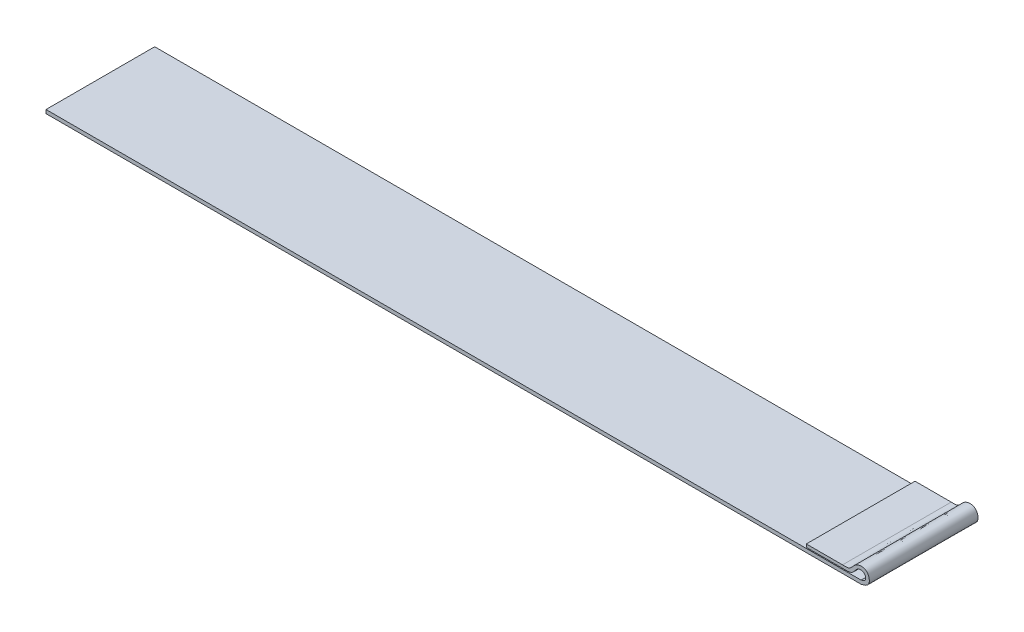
from build123d import *

# Parameters (mm, degrees)
EXTRUDE1_DEPTH = 76.2


with BuildPart() as part:
    # Sketch1 → Extrude1 (new body)
    with BuildSketch(Plane.XY):
        with BuildLine():
            Line((0, 0), (-571.499999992, 0))
            Line((-571.499999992, 0), (-571.499999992, -2.54))
            Line((-571.499999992, -2.54), (0.17919904, -2.54))
            add(Edge.make_bspline(
                [(0.17919904, -2.54), (2.162842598, -2.002925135), (6.81356084, -0.743735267), (5.0461953, 9.631832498), (-4.315393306, 8.377293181), (-7.449886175, 2.572502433), (-11.115893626, 2.688754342), (-13.022045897, 2.749199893)],
                knots=[0, 0, 0, 0, 0.177067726, 0.415141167, 0.676771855, 0.831936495, 1, 1, 1, 1], degree=3))
            Line((-13.022045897, 2.749199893), (-38.422045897, 2.749199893))
            Line((-38.422045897, 2.749199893), (-38.422045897, 0.662218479))
            Line((-38.422045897, 0.662218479), (-13.022045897, 0.662218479))
            add(Edge.make_bspline(
                [(0, 0), (1.297974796, 0.405515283), (3.975282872, 1.241963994), (2.440524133, 6.591260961), (-3.243869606, 6.061404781), (-5.746650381, 0.365445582), (-10.288474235, 0.550712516), (-13.022045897, 0.662218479)],
                knots=[0, 0, 0, 0, 0.147507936, 0.304261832, 0.492001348, 0.694252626, 1, 1, 1, 1], degree=3))
        make_face()
    extrude(amount=EXTRUDE1_DEPTH)


solid = part.part
